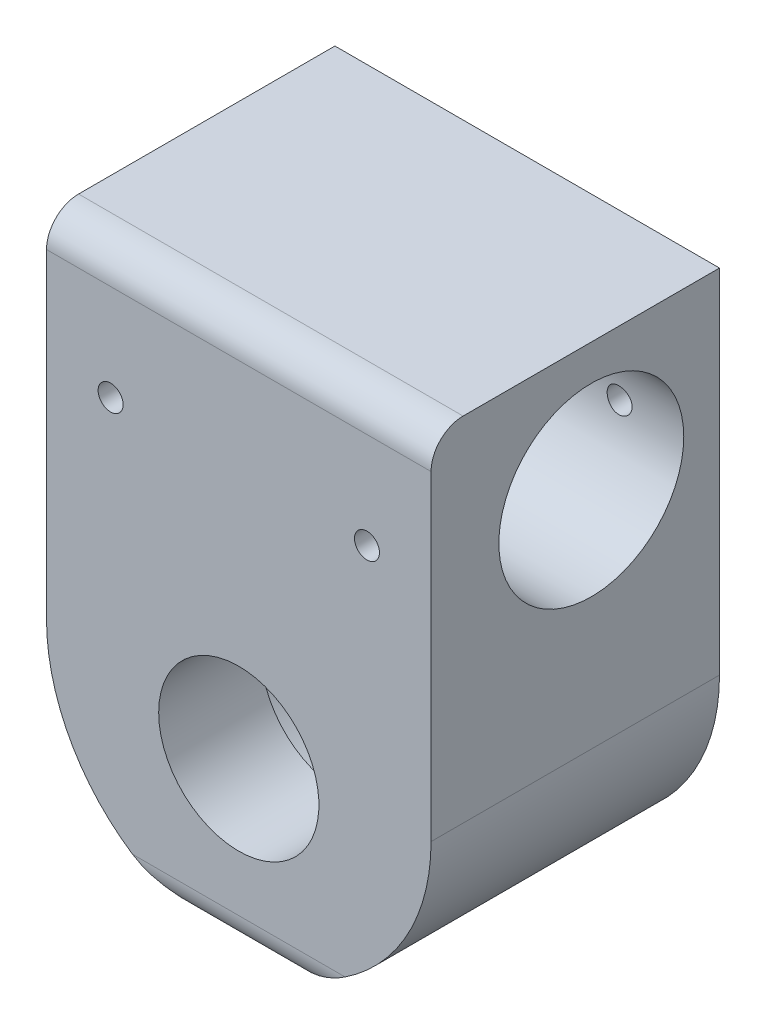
ISO-10303-21;
HEADER;
FILE_DESCRIPTION(('STEP AP214'),'2;1');
FILE_NAME('part.step','',(''),(''),'','','');
FILE_SCHEMA(('AUTOMOTIVE_DESIGN { 1 0 10303 214 1 1 1 1 }'));
ENDSEC;
DATA;
#1=APPLICATION_CONTEXT('core data for automotive mechanical design processes');
#2=APPLICATION_PROTOCOL_DEFINITION('international standard','automotive_design',2000,#1);
#3=PRODUCT_CONTEXT('',#1,'mechanical');
#4=PRODUCT('Part','Part','',(#3));
#5=PRODUCT_RELATED_PRODUCT_CATEGORY('part','',(#4));
#6=PRODUCT_DEFINITION_FORMATION('','',#4);
#7=PRODUCT_DEFINITION_CONTEXT('part definition',#1,'design');
#8=PRODUCT_DEFINITION('design','',#6,#7);
#9=PRODUCT_DEFINITION_SHAPE('','',#8);
#10=(LENGTH_UNIT() NAMED_UNIT(*) SI_UNIT(.MILLI.,.METRE.));
#11=(NAMED_UNIT(*) PLANE_ANGLE_UNIT() SI_UNIT($,.RADIAN.));
#12=(NAMED_UNIT(*) SI_UNIT($,.STERADIAN.) SOLID_ANGLE_UNIT());
#13=UNCERTAINTY_MEASURE_WITH_UNIT(LENGTH_MEASURE(1.E-05),#10,'distance_accuracy_value','');
#14=(GEOMETRIC_REPRESENTATION_CONTEXT(3) GLOBAL_UNCERTAINTY_ASSIGNED_CONTEXT((#13)) GLOBAL_UNIT_ASSIGNED_CONTEXT((#10,
#11,#12)) REPRESENTATION_CONTEXT('',''));
#15=CARTESIAN_POINT('',(0.,0.,0.));
#16=DIRECTION('',(0.,0.,1.));
#17=DIRECTION('',(1.,0.,0.));
#18=AXIS2_PLACEMENT_3D('',#15,#16,#17);
#19=CARTESIAN_POINT('',(0.,-63.5,114.3));
#20=DIRECTION('',(0.,0.,-1.));
#21=DIRECTION('',(-1.,0.,0.));
#22=AXIS2_PLACEMENT_3D('',#19,#20,#21);
#23=CYLINDRICAL_SURFACE('',#22,76.2);
#24=DIRECTION('',(0.,0.,-1.));
#25=VECTOR('',#24,1.);
#26=CARTESIAN_POINT('',(76.2,-63.5,114.3));
#27=LINE('',#26,#25);
#28=CARTESIAN_POINT('',(76.2,-63.5,114.3));
#29=VERTEX_POINT('',#28);
#30=CARTESIAN_POINT('',(76.2,-63.5,0.));
#31=VERTEX_POINT('',#30);
#32=EDGE_CURVE('E102',#29,#31,#27,.T.);
#33=ORIENTED_EDGE('',*,*,#32,.F.);
#34=CARTESIAN_POINT('',(0.,-63.5,114.3));
#35=DIRECTION('',(0.,0.,-1.));
#36=DIRECTION('',(-1.,0.,0.));
#37=AXIS2_PLACEMENT_3D('',#34,#35,#36);
#38=CIRCLE('',#37,76.2);
#39=CARTESIAN_POINT('',(42.1211348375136,-127.,114.3));
#40=VERTEX_POINT('',#39);
#41=EDGE_CURVE('E47',#40,#29,#38,.F.);
#42=ORIENTED_EDGE('',*,*,#41,.F.);
#43=CARTESIAN_POINT('',(0.,-139.7,101.6));
#44=CARTESIAN_POINT('',(0.0170377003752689,-139.699999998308,101.60695561));
#45=CARTESIAN_POINT('',(0.034075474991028,-139.699994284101,101.613911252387));
#46=CARTESIAN_POINT('',(2.03742847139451,-139.698650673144,102.431776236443));
#47=CARTESIAN_POINT('',(4.0247212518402,-139.619673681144,103.243032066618));
#48=CARTESIAN_POINT('',(7.00250718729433,-139.384106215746,104.444407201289));
#49=CARTESIAN_POINT('',(7.99501216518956,-139.285997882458,104.842452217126));
#50=CARTESIAN_POINT('',(9.97853241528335,-139.050421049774,105.630697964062));
#51=CARTESIAN_POINT('',(10.9695477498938,-138.912954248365,106.020899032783));
#52=CARTESIAN_POINT('',(12.9518201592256,-138.597936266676,106.791490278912));
#53=CARTESIAN_POINT('',(13.9430720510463,-138.420289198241,107.171854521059));
#54=CARTESIAN_POINT('',(15.9228290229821,-138.024643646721,107.918687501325));
#55=CARTESIAN_POINT('',(16.9113339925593,-137.806643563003,108.285155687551));
#56=CARTESIAN_POINT('',(18.884262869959,-137.329899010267,109.000530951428));
#57=CARTESIAN_POINT('',(19.8686886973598,-137.071176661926,109.349447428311));
#58=CARTESIAN_POINT('',(21.832988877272,-136.512349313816,110.026012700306));
#59=CARTESIAN_POINT('',(22.8128637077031,-136.212248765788,110.353663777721));
#60=CARTESIAN_POINT('',(24.9771687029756,-135.500990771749,111.051020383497));
#61=CARTESIAN_POINT('',(26.1603021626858,-135.079826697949,111.414630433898));
#62=CARTESIAN_POINT('',(28.5161425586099,-134.17433455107,112.094740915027));
#63=CARTESIAN_POINT('',(29.6888497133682,-133.690007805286,112.411242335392));
#64=CARTESIAN_POINT('',(31.434291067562,-132.917055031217,112.841203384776));
#65=CARTESIAN_POINT('',(32.0123214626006,-132.65242230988,112.976758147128));
#66=CARTESIAN_POINT('',(33.1644541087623,-132.107324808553,113.231671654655));
#67=CARTESIAN_POINT('',(33.7385566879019,-131.826861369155,113.351031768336));
#68=CARTESIAN_POINT('',(34.8822425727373,-131.250123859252,113.571707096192));
#69=CARTESIAN_POINT('',(35.4518261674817,-130.953850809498,113.673023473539));
#70=CARTESIAN_POINT('',(36.5857689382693,-130.345608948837,113.855517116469));
#71=CARTESIAN_POINT('',(37.1501285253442,-130.03364138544,113.93669597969));
#72=CARTESIAN_POINT('',(38.451388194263,-129.292519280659,114.098820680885));
#73=CARTESIAN_POINT('',(39.1860955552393,-128.857642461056,114.171485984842));
#74=CARTESIAN_POINT('',(40.6424150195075,-127.962112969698,114.271512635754));
#75=CARTESIAN_POINT('',(41.3640344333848,-127.501475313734,114.298900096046));
#76=CARTESIAN_POINT('',(42.4374430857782,-126.790519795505,114.300505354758));
#77=CARTESIAN_POINT('',(42.7952115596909,-126.549155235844,114.294352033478));
#78=CARTESIAN_POINT('',(43.5062227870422,-126.060647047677,114.267575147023));
#79=CARTESIAN_POINT('',(43.8594658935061,-125.813503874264,114.246952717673));
#80=CARTESIAN_POINT('',(44.5614700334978,-125.313439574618,114.190034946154));
#81=CARTESIAN_POINT('',(44.9102226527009,-125.06050953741,114.153713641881));
#82=CARTESIAN_POINT('',(45.6020762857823,-124.549782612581,114.064089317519));
#83=CARTESIAN_POINT('',(45.9451756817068,-124.291984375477,114.010781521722));
#84=CARTESIAN_POINT('',(46.2850648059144,-124.032080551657,113.948338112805));
#85=B_SPLINE_CURVE_WITH_KNOTS('',3,(#43,#44,#45,#46,#47,#48,#49,#50,#51,#52,#53,#54,#55,#56,#57,
#58,#59,#60,#61,#62,#63,#64,#65,#66,#67,#68,#69,#70,#71,#72,#73,#74,#75,#76,#77,#78,#79,#80,#81,
#82,#83,#84),.UNSPECIFIED.,.F.,.F.,(4,2,2,2,2,2,2,2,2,2,2,2,2,2,2,2,2,2,2,2,4),(0.,
0.0552086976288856,6.49157800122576,9.71259317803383,12.9334694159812,16.162114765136,
19.3908882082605,22.6179137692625,25.8445924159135,29.7647298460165,33.6847849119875,
35.6345088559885,37.5840679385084,39.5335012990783,41.4827799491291,44.051827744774,
46.6193933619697,47.9139912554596,49.2084875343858,50.5051328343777,51.8021430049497),.UNSPECIFIED.);
#86=CARTESIAN_POINT('',(0.,-139.7,101.6));
#87=VERTEX_POINT('',#86);
#88=EDGE_CURVE('E230',#87,#40,#85,.T.);
#89=ORIENTED_EDGE('',*,*,#88,.F.);
#90=DIRECTION('',(0.,0.,1.));
#91=VECTOR('',#90,1.);
#92=CARTESIAN_POINT('',(0.,-139.7,114.3));
#93=LINE('',#92,#91);
#94=CARTESIAN_POINT('',(0.,-139.7,0.));
#95=VERTEX_POINT('',#94);
#96=EDGE_CURVE('E157',#87,#95,#93,.F.);
#97=ORIENTED_EDGE('',*,*,#96,.T.);
#98=CARTESIAN_POINT('',(0.,-63.5,0.));
#99=DIRECTION('',(0.,0.,-1.));
#100=DIRECTION('',(-1.,0.,0.));
#101=AXIS2_PLACEMENT_3D('',#98,#99,#100);
#102=CIRCLE('',#101,76.2);
#103=EDGE_CURVE('E11',#31,#95,#102,.T.);
#104=ORIENTED_EDGE('',*,*,#103,.F.);
#105=EDGE_LOOP('',(#33,#42,#89,#97,#104));
#106=FACE_BOUND('',#105,.T.);
#107=ADVANCED_FACE('F34',(#106),#23,.T.);
#108=CARTESIAN_POINT('',(0.,-63.5,114.3));
#109=DIRECTION('',(0.,0.,1.));
#110=DIRECTION('',(1.,0.,0.));
#111=AXIS2_PLACEMENT_3D('',#108,#109,#110);
#112=CYLINDRICAL_SURFACE('',#111,76.2);
#113=DIRECTION('',(0.,0.,1.));
#114=VECTOR('',#113,1.);
#115=CARTESIAN_POINT('',(-76.2,-63.5,114.3));
#116=LINE('',#115,#114);
#117=CARTESIAN_POINT('',(-76.2,-63.5,0.));
#118=VERTEX_POINT('',#117);
#119=CARTESIAN_POINT('',(-76.2,-63.5,114.3));
#120=VERTEX_POINT('',#119);
#121=EDGE_CURVE('E144',#118,#120,#116,.T.);
#122=ORIENTED_EDGE('',*,*,#121,.F.);
#123=CARTESIAN_POINT('',(0.,-63.5,0.));
#124=DIRECTION('',(0.,0.,-1.));
#125=DIRECTION('',(-1.,0.,0.));
#126=AXIS2_PLACEMENT_3D('',#123,#124,#125);
#127=CIRCLE('',#126,76.2);
#128=EDGE_CURVE('E231',#95,#118,#127,.T.);
#129=ORIENTED_EDGE('',*,*,#128,.F.);
#130=ORIENTED_EDGE('',*,*,#96,.F.);
#131=CARTESIAN_POINT('',(-42.1211348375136,-127.,114.3));
#132=CARTESIAN_POINT('',(-41.6720587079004,-127.29789461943,114.299965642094));
#133=CARTESIAN_POINT('',(-41.2198731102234,-127.590969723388,114.28952012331));
#134=CARTESIAN_POINT('',(-40.3101054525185,-128.167030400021,114.249568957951));
#135=CARTESIAN_POINT('',(-39.8525248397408,-128.450018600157,114.220068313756));
#136=CARTESIAN_POINT('',(-38.9332683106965,-129.005179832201,114.143826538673));
#137=CARTESIAN_POINT('',(-38.4715998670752,-129.277368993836,114.097112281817));
#138=CARTESIAN_POINT('',(-37.5440212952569,-129.811182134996,113.987956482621));
#139=CARTESIAN_POINT('',(-37.0781108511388,-130.072805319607,113.925513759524));
#140=CARTESIAN_POINT('',(-35.6797528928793,-130.838849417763,113.717444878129));
#141=CARTESIAN_POINT('',(-34.7416983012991,-131.327449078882,113.550634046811));
#142=CARTESIAN_POINT('',(-32.8535333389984,-132.26187942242,113.1696716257));
#143=CARTESIAN_POINT('',(-31.9034162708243,-132.707685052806,112.955492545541));
#144=CARTESIAN_POINT('',(-30.0591378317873,-133.527393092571,112.503527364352));
#145=CARTESIAN_POINT('',(-29.1655879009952,-133.904127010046,112.268353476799));
#146=CARTESIAN_POINT('',(-27.3717723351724,-134.620736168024,111.768833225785));
#147=CARTESIAN_POINT('',(-26.4715056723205,-134.960605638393,111.504482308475));
#148=CARTESIAN_POINT('',(-24.6651294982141,-135.604029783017,110.950980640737));
#149=CARTESIAN_POINT('',(-23.7590172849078,-135.907566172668,110.661817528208));
#150=CARTESIAN_POINT('',(-21.9424144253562,-136.478606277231,110.06269851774));
#151=CARTESIAN_POINT('',(-21.0319239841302,-136.746111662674,109.752743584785));
#152=CARTESIAN_POINT('',(-19.2043072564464,-137.246424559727,109.114371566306));
#153=CARTESIAN_POINT('',(-18.287168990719,-137.479114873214,108.785897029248));
#154=CARTESIAN_POINT('',(-16.449978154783,-137.909195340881,108.114474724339));
#155=CARTESIAN_POINT('',(-15.5299255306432,-138.106584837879,107.771526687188));
#156=CARTESIAN_POINT('',(-12.7671742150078,-138.646255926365,106.725469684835));
#157=CARTESIAN_POINT('',(-10.9206651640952,-138.936371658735,106.004715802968));
#158=CARTESIAN_POINT('',(-7.56935550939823,-139.338215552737,104.67359254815));
#159=CARTESIAN_POINT('',(-6.06537250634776,-139.47318636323,104.067852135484));
#160=CARTESIAN_POINT('',(-3.05785098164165,-139.653493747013,102.848321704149));
#161=CARTESIAN_POINT('',(-1.55431566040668,-139.698974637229,102.234546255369));
#162=CARTESIAN_POINT('',(-0.0340755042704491,-139.699994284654,101.613911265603));
#163=CARTESIAN_POINT('',(-0.0170377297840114,-139.699999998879,101.60695562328));
#164=CARTESIAN_POINT('',(0.,-139.7,101.6));
#165=B_SPLINE_CURVE_WITH_KNOTS('',3,(#131,#132,#133,#134,#135,#136,#137,#138,#139,#140,#141,
#142,#143,#144,#145,#146,#147,#148,#149,#150,#151,#152,#153,#154,#155,#156,#157,#158,#159,#160,
#161,#162,#163,#164),.UNSPECIFIED.,.F.,.F.,(4,2,2,2,2,2,2,2,2,2,2,2,2,2,2,2,4),(0.,
1.61645535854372,3.23248653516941,4.84600536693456,6.45964536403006,9.66946355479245,
12.8811494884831,15.8734327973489,18.8661837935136,21.8604346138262,24.8545465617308,
27.8585211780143,30.8625517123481,36.8666229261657,41.7454171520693,46.6163370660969,
46.6715457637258),.UNSPECIFIED.);
#166=CARTESIAN_POINT('',(-42.1211348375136,-127.,114.3));
#167=VERTEX_POINT('',#166);
#168=EDGE_CURVE('E150',#167,#87,#165,.T.);
#169=ORIENTED_EDGE('',*,*,#168,.F.);
#170=CARTESIAN_POINT('',(0.,-63.5,114.3));
#171=DIRECTION('',(0.,0.,-1.));
#172=DIRECTION('',(-1.,0.,0.));
#173=AXIS2_PLACEMENT_3D('',#170,#171,#172);
#174=CIRCLE('',#173,76.2);
#175=EDGE_CURVE('E147',#120,#167,#174,.F.);
#176=ORIENTED_EDGE('',*,*,#175,.F.);
#177=EDGE_LOOP('',(#122,#129,#130,#169,#176));
#178=FACE_BOUND('',#177,.T.);
#179=ADVANCED_FACE('F163',(#178),#112,.T.);
#180=CARTESIAN_POINT('',(0.,-73.152,114.3));
#181=DIRECTION('',(0.,0.,-1.));
#182=DIRECTION('',(-1.,0.,0.));
#183=AXIS2_PLACEMENT_3D('',#180,#181,#182);
#184=CYLINDRICAL_SURFACE('',#183,31.75);
#185=CARTESIAN_POINT('',(0.,-73.152,114.3));
#186=DIRECTION('',(0.,0.,-1.));
#187=DIRECTION('',(-1.,0.,0.));
#188=AXIS2_PLACEMENT_3D('',#185,#186,#187);
#189=CIRCLE('',#188,31.75);
#190=CARTESIAN_POINT('',(-31.75,-73.152,114.3));
#191=VERTEX_POINT('',#190);
#192=EDGE_CURVE('E132',#191,#191,#189,.T.);
#193=ORIENTED_EDGE('',*,*,#192,.F.);
#194=EDGE_LOOP('',(#193));
#195=FACE_BOUND('',#194,.T.);
#196=CARTESIAN_POINT('',(0.,-73.152,73.66));
#197=DIRECTION('',(0.,0.,-1.));
#198=DIRECTION('',(-1.,0.,0.));
#199=AXIS2_PLACEMENT_3D('',#196,#197,#198);
#200=CIRCLE('',#199,31.75);
#201=CARTESIAN_POINT('',(-31.75,-73.152,73.66));
#202=VERTEX_POINT('',#201);
#203=EDGE_CURVE('E129',#202,#202,#200,.F.);
#204=ORIENTED_EDGE('',*,*,#203,.F.);
#205=EDGE_LOOP('',(#204));
#206=FACE_BOUND('',#205,.T.);
#207=ADVANCED_FACE('F167',(#195,#206),#184,.F.);
#208=CARTESIAN_POINT('',(-76.2,-139.7,114.3));
#209=DIRECTION('',(1.,0.,0.));
#210=DIRECTION('',(0.,0.,-1.));
#211=AXIS2_PLACEMENT_3D('',#208,#209,#210);
#212=PLANE('',#211);
#213=CARTESIAN_POINT('',(-76.2,25.4,50.8));
#214=DIRECTION('',(1.,0.,0.));
#215=DIRECTION('',(0.,0.,-1.));
#216=AXIS2_PLACEMENT_3D('',#213,#214,#215);
#217=CIRCLE('',#216,36.6395);
#218=CARTESIAN_POINT('',(-76.2,25.4,14.1605));
#219=VERTEX_POINT('',#218);
#220=EDGE_CURVE('E277',#219,#219,#217,.T.);
#221=ORIENTED_EDGE('',*,*,#220,.T.);
#222=EDGE_LOOP('',(#221));
#223=FACE_BOUND('',#222,.T.);
#224=DIRECTION('',(0.,-1.,0.));
#225=VECTOR('',#224,1.);
#226=CARTESIAN_POINT('',(-76.2,-139.7,0.));
#227=LINE('',#226,#225);
#228=CARTESIAN_POINT('',(-76.2,76.2,0.));
#229=VERTEX_POINT('',#228);
#230=EDGE_CURVE('E106',#229,#118,#227,.T.);
#231=ORIENTED_EDGE('',*,*,#230,.T.);
#232=ORIENTED_EDGE('',*,*,#121,.T.);
#233=DIRECTION('',(0.,-1.,0.));
#234=VECTOR('',#233,1.);
#235=CARTESIAN_POINT('',(-76.2,-139.7,114.3));
#236=LINE('',#235,#234);
#237=CARTESIAN_POINT('',(-76.2,63.5,114.3));
#238=VERTEX_POINT('',#237);
#239=EDGE_CURVE('E120',#238,#120,#236,.T.);
#240=ORIENTED_EDGE('',*,*,#239,.F.);
#241=CARTESIAN_POINT('',(-76.2,63.5,101.6));
#242=DIRECTION('',(1.,0.,0.));
#243=DIRECTION('',(0.,0.,-1.));
#244=AXIS2_PLACEMENT_3D('',#241,#242,#243);
#245=CIRCLE('',#244,12.7);
#246=CARTESIAN_POINT('',(-76.2,76.2,101.6));
#247=VERTEX_POINT('',#246);
#248=EDGE_CURVE('E136',#238,#247,#245,.F.);
#249=ORIENTED_EDGE('',*,*,#248,.T.);
#250=DIRECTION('',(0.,0.,-1.));
#251=VECTOR('',#250,1.);
#252=CARTESIAN_POINT('',(-76.2,76.2,114.3));
#253=LINE('',#252,#251);
#254=EDGE_CURVE('E116',#247,#229,#253,.T.);
#255=ORIENTED_EDGE('',*,*,#254,.T.);
#256=EDGE_LOOP('',(#231,#232,#240,#249,#255));
#257=FACE_BOUND('',#256,.T.);
#258=ADVANCED_FACE('F169',(#223,#257),#212,.F.);
#259=CARTESIAN_POINT('',(76.2,-139.7,114.3));
#260=DIRECTION('',(-1.,0.,0.));
#261=DIRECTION('',(0.,0.,1.));
#262=AXIS2_PLACEMENT_3D('',#259,#260,#261);
#263=PLANE('',#262);
#264=CARTESIAN_POINT('',(76.2,25.4,50.8));
#265=DIRECTION('',(1.,0.,0.));
#266=DIRECTION('',(0.,0.,-1.));
#267=AXIS2_PLACEMENT_3D('',#264,#265,#266);
#268=CIRCLE('',#267,36.6395);
#269=CARTESIAN_POINT('',(76.2,25.4,14.1605));
#270=VERTEX_POINT('',#269);
#271=EDGE_CURVE('E274',#270,#270,#268,.T.);
#272=ORIENTED_EDGE('',*,*,#271,.F.);
#273=EDGE_LOOP('',(#272));
#274=FACE_BOUND('',#273,.T.);
#275=DIRECTION('',(0.,1.,0.));
#276=VECTOR('',#275,1.);
#277=CARTESIAN_POINT('',(76.2,-139.7,114.3));
#278=LINE('',#277,#276);
#279=CARTESIAN_POINT('',(76.2,63.5,114.3));
#280=VERTEX_POINT('',#279);
#281=EDGE_CURVE('E123',#29,#280,#278,.T.);
#282=ORIENTED_EDGE('',*,*,#281,.F.);
#283=ORIENTED_EDGE('',*,*,#32,.T.);
#284=DIRECTION('',(0.,1.,0.));
#285=VECTOR('',#284,1.);
#286=CARTESIAN_POINT('',(76.2,-139.7,0.));
#287=LINE('',#286,#285);
#288=CARTESIAN_POINT('',(76.2,76.2,0.));
#289=VERTEX_POINT('',#288);
#290=EDGE_CURVE('E95',#31,#289,#287,.T.);
#291=ORIENTED_EDGE('',*,*,#290,.T.);
#292=DIRECTION('',(0.,0.,-1.));
#293=VECTOR('',#292,1.);
#294=CARTESIAN_POINT('',(76.2,76.2,114.3));
#295=LINE('',#294,#293);
#296=CARTESIAN_POINT('',(76.2,76.2,101.6));
#297=VERTEX_POINT('',#296);
#298=EDGE_CURVE('E100',#297,#289,#295,.T.);
#299=ORIENTED_EDGE('',*,*,#298,.F.);
#300=CARTESIAN_POINT('',(76.2,63.5,101.6));
#301=DIRECTION('',(-1.,0.,0.));
#302=DIRECTION('',(0.,0.,1.));
#303=AXIS2_PLACEMENT_3D('',#300,#301,#302);
#304=CIRCLE('',#303,12.7);
#305=EDGE_CURVE('E139',#297,#280,#304,.F.);
#306=ORIENTED_EDGE('',*,*,#305,.T.);
#307=EDGE_LOOP('',(#282,#283,#291,#299,#306));
#308=FACE_BOUND('',#307,.T.);
#309=ADVANCED_FACE('F98',(#274,#308),#263,.F.);
#310=CARTESIAN_POINT('',(-76.2,76.2,114.3));
#311=DIRECTION('',(0.,-1.,0.));
#312=DIRECTION('',(0.,0.,-1.));
#313=AXIS2_PLACEMENT_3D('',#310,#311,#312);
#314=PLANE('',#313);
#315=ORIENTED_EDGE('',*,*,#254,.F.);
#316=DIRECTION('',(-1.,0.,0.));
#317=VECTOR('',#316,1.);
#318=CARTESIAN_POINT('',(-76.2,76.2,101.6));
#319=LINE('',#318,#317);
#320=EDGE_CURVE('E114',#247,#297,#319,.F.);
#321=ORIENTED_EDGE('',*,*,#320,.T.);
#322=ORIENTED_EDGE('',*,*,#298,.T.);
#323=DIRECTION('',(-1.,0.,0.));
#324=VECTOR('',#323,1.);
#325=CARTESIAN_POINT('',(-76.2,76.2,0.));
#326=LINE('',#325,#324);
#327=EDGE_CURVE('E105',#289,#229,#326,.T.);
#328=ORIENTED_EDGE('',*,*,#327,.T.);
#329=EDGE_LOOP('',(#315,#321,#322,#328));
#330=FACE_BOUND('',#329,.T.);
#331=ADVANCED_FACE('F111',(#330),#314,.F.);
#332=CARTESIAN_POINT('',(-76.2,76.2,114.3));
#333=DIRECTION('',(0.,0.,-1.));
#334=DIRECTION('',(-1.,0.,0.));
#335=AXIS2_PLACEMENT_3D('',#332,#333,#334);
#336=PLANE('',#335);
#337=CARTESIAN_POINT('',(50.8,25.4,114.3));
#338=DIRECTION('',(0.,0.,1.));
#339=DIRECTION('',(1.,0.,0.));
#340=AXIS2_PLACEMENT_3D('',#337,#338,#339);
#341=CIRCLE('',#340,4.953);
#342=CARTESIAN_POINT('',(55.753,25.4,114.3));
#343=VERTEX_POINT('',#342);
#344=EDGE_CURVE('E299',#343,#343,#341,.T.);
#345=ORIENTED_EDGE('',*,*,#344,.F.);
#346=EDGE_LOOP('',(#345));
#347=FACE_BOUND('',#346,.T.);
#348=CARTESIAN_POINT('',(-50.8,25.4,114.3));
#349=DIRECTION('',(0.,0.,1.));
#350=DIRECTION('',(1.,0.,0.));
#351=AXIS2_PLACEMENT_3D('',#348,#349,#350);
#352=CIRCLE('',#351,4.953);
#353=CARTESIAN_POINT('',(-45.847,25.4,114.3));
#354=VERTEX_POINT('',#353);
#355=EDGE_CURVE('E294',#354,#354,#352,.T.);
#356=ORIENTED_EDGE('',*,*,#355,.F.);
#357=EDGE_LOOP('',(#356));
#358=FACE_BOUND('',#357,.T.);
#359=ORIENTED_EDGE('',*,*,#192,.T.);
#360=EDGE_LOOP('',(#359));
#361=FACE_BOUND('',#360,.T.);
#362=DIRECTION('',(1.,0.,0.));
#363=VECTOR('',#362,1.);
#364=CARTESIAN_POINT('',(-76.2,-127.,114.3));
#365=LINE('',#364,#363);
#366=EDGE_CURVE('E141',#167,#40,#365,.T.);
#367=ORIENTED_EDGE('',*,*,#366,.T.);
#368=ORIENTED_EDGE('',*,*,#41,.T.);
#369=ORIENTED_EDGE('',*,*,#281,.T.);
#370=DIRECTION('',(-1.,0.,0.));
#371=VECTOR('',#370,1.);
#372=CARTESIAN_POINT('',(-76.2,63.5,114.3));
#373=LINE('',#372,#371);
#374=EDGE_CURVE('E115',#280,#238,#373,.T.);
#375=ORIENTED_EDGE('',*,*,#374,.T.);
#376=ORIENTED_EDGE('',*,*,#239,.T.);
#377=ORIENTED_EDGE('',*,*,#175,.T.);
#378=EDGE_LOOP('',(#367,#368,#369,#375,#376,#377));
#379=FACE_BOUND('',#378,.T.);
#380=ADVANCED_FACE('F178',(#347,#358,#361,#379),#336,.F.);
#381=CARTESIAN_POINT('',(-76.2,76.2,0.));
#382=DIRECTION('',(0.,0.,-1.));
#383=DIRECTION('',(-1.,0.,0.));
#384=AXIS2_PLACEMENT_3D('',#381,#382,#383);
#385=PLANE('',#384);
#386=CARTESIAN_POINT('',(50.8,25.4,0.));
#387=DIRECTION('',(0.,0.,1.));
#388=DIRECTION('',(1.,0.,0.));
#389=AXIS2_PLACEMENT_3D('',#386,#387,#388);
#390=CIRCLE('',#389,4.953);
#391=CARTESIAN_POINT('',(55.753,25.4,0.));
#392=VERTEX_POINT('',#391);
#393=EDGE_CURVE('E206',#392,#392,#390,.T.);
#394=ORIENTED_EDGE('',*,*,#393,.T.);
#395=EDGE_LOOP('',(#394));
#396=FACE_BOUND('',#395,.T.);
#397=CARTESIAN_POINT('',(-50.8,25.4,0.));
#398=DIRECTION('',(0.,0.,1.));
#399=DIRECTION('',(1.,0.,0.));
#400=AXIS2_PLACEMENT_3D('',#397,#398,#399);
#401=CIRCLE('',#400,4.953);
#402=CARTESIAN_POINT('',(-45.847,25.4,0.));
#403=VERTEX_POINT('',#402);
#404=EDGE_CURVE('E291',#403,#403,#401,.T.);
#405=ORIENTED_EDGE('',*,*,#404,.T.);
#406=EDGE_LOOP('',(#405));
#407=FACE_BOUND('',#406,.T.);
#408=CARTESIAN_POINT('',(0.,-73.152,0.));
#409=DIRECTION('',(0.,0.,-1.));
#410=DIRECTION('',(-1.,0.,0.));
#411=AXIS2_PLACEMENT_3D('',#408,#409,#410);
#412=CIRCLE('',#411,55.0545);
#413=CARTESIAN_POINT('',(-55.0545,-73.152,0.));
#414=VERTEX_POINT('',#413);
#415=EDGE_CURVE('E288',#414,#414,#412,.T.);
#416=ORIENTED_EDGE('',*,*,#415,.F.);
#417=EDGE_LOOP('',(#416));
#418=FACE_BOUND('',#417,.T.);
#419=ORIENTED_EDGE('',*,*,#290,.F.);
#420=ORIENTED_EDGE('',*,*,#103,.T.);
#421=ORIENTED_EDGE('',*,*,#128,.T.);
#422=ORIENTED_EDGE('',*,*,#230,.F.);
#423=ORIENTED_EDGE('',*,*,#327,.F.);
#424=EDGE_LOOP('',(#419,#420,#421,#422,#423));
#425=FACE_BOUND('',#424,.T.);
#426=ADVANCED_FACE('F118',(#396,#407,#418,#425),#385,.T.);
#427=CARTESIAN_POINT('',(-76.2,25.4,50.8));
#428=DIRECTION('',(1.,0.,0.));
#429=DIRECTION('',(0.,0.,-1.));
#430=AXIS2_PLACEMENT_3D('',#427,#428,#429);
#431=CYLINDRICAL_SURFACE('',#430,36.6395);
#432=CARTESIAN_POINT('',(45.847,25.4,14.1605));
#433=CARTESIAN_POINT('',(45.84699829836,25.538477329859,14.1604993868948));
#434=CARTESIAN_POINT('',(45.8528093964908,25.6769301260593,14.1612865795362));
#435=CARTESIAN_POINT('',(45.8760084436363,25.9528883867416,14.1644120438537));
#436=CARTESIAN_POINT('',(45.8933989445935,26.0903936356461,14.1667506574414));
#437=CARTESIAN_POINT('',(45.93964732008,26.3635261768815,14.1729163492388));
#438=CARTESIAN_POINT('',(45.9685134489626,26.4991520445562,14.1767444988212));
#439=CARTESIAN_POINT('',(46.0375095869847,26.7675141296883,14.1857828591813));
#440=CARTESIAN_POINT('',(46.0776437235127,26.9002492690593,14.190993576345));
#441=CARTESIAN_POINT('',(46.1688257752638,27.1616984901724,14.2026437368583));
#442=CARTESIAN_POINT('',(46.2198618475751,27.2904167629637,14.2090818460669));
#443=CARTESIAN_POINT('',(46.3325231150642,27.5431298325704,14.2230130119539));
#444=CARTESIAN_POINT('',(46.3941522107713,27.6671228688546,14.2305064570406));
#445=CARTESIAN_POINT('',(46.5275087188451,27.9094100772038,14.2463332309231));
#446=CARTESIAN_POINT('',(46.5992306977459,28.0277072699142,14.2546661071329));
#447=CARTESIAN_POINT('',(46.7523195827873,28.2579023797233,14.2719466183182));
#448=CARTESIAN_POINT('',(46.8336900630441,28.3697979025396,14.2808944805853));
#449=CARTESIAN_POINT('',(47.0059466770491,28.5869543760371,14.2992024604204));
#450=CARTESIAN_POINT('',(47.0968813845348,28.6921766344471,14.3085645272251));
#451=CARTESIAN_POINT('',(47.2873034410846,28.8946375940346,14.3273964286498));
#452=CARTESIAN_POINT('',(47.3867939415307,28.9918733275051,14.3368663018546));
#453=CARTESIAN_POINT('',(47.5935750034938,29.1776124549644,14.3556408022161));
#454=CARTESIAN_POINT('',(47.7008631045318,29.2661185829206,14.3649454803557));
#455=CARTESIAN_POINT('',(47.9225642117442,29.4338443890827,14.3831332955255));
#456=CARTESIAN_POINT('',(48.0369798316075,29.5130606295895,14.3920162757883));
#457=CARTESIAN_POINT('',(48.2725312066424,29.661875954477,14.4091356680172));
#458=CARTESIAN_POINT('',(48.3936897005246,29.7314393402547,14.4173696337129));
#459=CARTESIAN_POINT('',(48.6415391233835,29.8601304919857,14.43292149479));
#460=CARTESIAN_POINT('',(48.7682320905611,29.9192543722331,14.4402390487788));
#461=CARTESIAN_POINT('',(49.0261724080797,30.0265795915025,14.4537394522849));
#462=CARTESIAN_POINT('',(49.1574178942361,30.0747853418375,14.4599227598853));
#463=CARTESIAN_POINT('',(49.4235734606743,30.1599601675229,14.4709818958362));
#464=CARTESIAN_POINT('',(49.5584848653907,30.1969251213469,14.4758572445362));
#465=CARTESIAN_POINT('',(49.9655119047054,30.2900705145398,14.4882346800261));
#466=CARTESIAN_POINT('',(50.2417981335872,30.3292800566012,14.4935895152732));
#467=CARTESIAN_POINT('',(50.7969259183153,30.3608061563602,14.4978845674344));
#468=CARTESIAN_POINT('',(51.0757673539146,30.3531249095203,14.4968250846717));
#469=CARTESIAN_POINT('',(51.6263043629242,30.2913800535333,14.4884548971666));
#470=CARTESIAN_POINT('',(51.8980352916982,30.2376274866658,14.4811861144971));
#471=CARTESIAN_POINT('',(52.4285740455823,30.0857352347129,14.4612788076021));
#472=CARTESIAN_POINT('',(52.6873815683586,29.9875945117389,14.4486401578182));
#473=CARTESIAN_POINT('',(53.1856988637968,29.7493859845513,14.4193708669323));
#474=CARTESIAN_POINT('',(53.4251438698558,29.6091843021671,14.4027275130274));
#475=CARTESIAN_POINT('',(53.8772253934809,29.2909280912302,14.3673334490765));
#476=CARTESIAN_POINT('',(54.0898604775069,29.1128715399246,14.3485826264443));
#477=CARTESIAN_POINT('',(54.484092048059,28.7222423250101,14.310900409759));
#478=CARTESIAN_POINT('',(54.6654231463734,28.5094017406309,14.2919687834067));
#479=CARTESIAN_POINT('',(54.9898283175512,28.0561650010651,14.2561997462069));
#480=CARTESIAN_POINT('',(55.1329022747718,27.8157687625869,14.2393623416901));
#481=CARTESIAN_POINT('',(55.3767372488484,27.3140302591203,14.2096658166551));
#482=CARTESIAN_POINT('',(55.4774801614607,27.0526790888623,14.1968083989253));
#483=CARTESIAN_POINT('',(55.6335749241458,26.5165567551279,14.1765354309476));
#484=CARTESIAN_POINT('',(55.6889292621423,26.2417863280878,14.1691195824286));
#485=CARTESIAN_POINT('',(55.7523281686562,25.688918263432,14.1606043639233));
#486=CARTESIAN_POINT('',(55.7607380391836,25.4108632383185,14.1594562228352));
#487=CARTESIAN_POINT('',(55.7309754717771,24.8573098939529,14.1634736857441));
#488=CARTESIAN_POINT('',(55.6928041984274,24.581811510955,14.1686391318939));
#489=CARTESIAN_POINT('',(55.571266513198,24.042280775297,14.1846731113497));
#490=CARTESIAN_POINT('',(55.4880757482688,23.778208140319,14.1955194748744));
#491=CARTESIAN_POINT('',(55.2790441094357,23.2677607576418,14.2217018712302));
#492=CARTESIAN_POINT('',(55.1532015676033,23.021386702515,14.2370380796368));
#493=CARTESIAN_POINT('',(54.8615653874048,22.5517083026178,14.2706141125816));
#494=CARTESIAN_POINT('',(54.6955372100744,22.3285508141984,14.2888707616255));
#495=CARTESIAN_POINT('',(54.3285714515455,21.9131379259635,14.326196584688));
#496=CARTESIAN_POINT('',(54.1276322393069,21.7208839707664,14.345265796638));
#497=CARTESIAN_POINT('',(53.6949361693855,21.3714262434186,14.382219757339));
#498=CARTESIAN_POINT('',(53.4629820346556,21.2144656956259,14.4000957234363));
#499=CARTESIAN_POINT('',(52.975776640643,20.9417359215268,14.4324899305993));
#500=CARTESIAN_POINT('',(52.7205259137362,20.8259657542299,14.4470082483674));
#501=CARTESIAN_POINT('',(52.1947870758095,20.6392853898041,14.4709836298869));
#502=CARTESIAN_POINT('',(51.9243469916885,20.5682416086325,14.4804557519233));
#503=CARTESIAN_POINT('',(51.3750850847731,20.4726207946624,14.4933019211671));
#504=CARTESIAN_POINT('',(51.0962637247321,20.4480412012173,14.4966763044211));
#505=CARTESIAN_POINT('',(50.6793254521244,20.4465301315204,14.4968875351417));
#506=CARTESIAN_POINT('',(50.5410527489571,20.4518383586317,14.4961606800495));
#507=CARTESIAN_POINT('',(50.2654657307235,20.4739921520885,14.4931471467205));
#508=CARTESIAN_POINT('',(50.1281510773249,20.4908334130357,14.4908610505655));
#509=CARTESIAN_POINT('',(49.8554042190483,20.5359407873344,14.4847911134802));
#510=CARTESIAN_POINT('',(49.7199727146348,20.5642110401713,14.481006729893));
#511=CARTESIAN_POINT('',(49.4520373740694,20.631951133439,14.472051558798));
#512=CARTESIAN_POINT('',(49.3195324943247,20.6714169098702,14.4668812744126));
#513=CARTESIAN_POINT('',(49.0583519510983,20.7612565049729,14.4553020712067));
#514=CARTESIAN_POINT('',(48.9296757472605,20.8116287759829,14.4488933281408));
#515=CARTESIAN_POINT('',(48.6770732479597,20.9228992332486,14.4350213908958));
#516=CARTESIAN_POINT('',(48.5531452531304,20.9837936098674,14.4275585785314));
#517=CARTESIAN_POINT('',(48.3107997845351,21.1157110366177,14.4117843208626));
#518=CARTESIAN_POINT('',(48.1923843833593,21.186737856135,14.403472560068));
#519=CARTESIAN_POINT('',(47.9619668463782,21.3383757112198,14.3862390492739));
#520=CARTESIAN_POINT('',(47.8499624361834,21.4189833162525,14.3773175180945));
#521=CARTESIAN_POINT('',(47.6321969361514,21.5899408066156,14.3590360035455));
#522=CARTESIAN_POINT('',(47.5264944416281,21.6803650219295,14.3496730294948));
#523=CARTESIAN_POINT('',(47.3231081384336,21.8697404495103,14.3308448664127));
#524=CARTESIAN_POINT('',(47.2254214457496,21.9686885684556,14.3213797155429));
#525=CARTESIAN_POINT('',(47.0386463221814,22.1745153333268,14.3026043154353));
#526=CARTESIAN_POINT('',(46.9495631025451,22.2813987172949,14.2932941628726));
#527=CARTESIAN_POINT('',(46.7807172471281,22.5022611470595,14.2750997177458));
#528=CARTESIAN_POINT('',(46.7009511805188,22.616237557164,14.2662152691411));
#529=CARTESIAN_POINT('',(46.5509042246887,22.8510972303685,14.2490768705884));
#530=CARTESIAN_POINT('',(46.480670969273,22.9720111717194,14.2408261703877));
#531=CARTESIAN_POINT('',(46.350679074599,23.2193432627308,14.225240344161));
#532=CARTESIAN_POINT('',(46.2909165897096,23.3457593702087,14.2179048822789));
#533=CARTESIAN_POINT('',(46.1823140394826,23.6031476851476,14.204359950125));
#534=CARTESIAN_POINT('',(46.1334656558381,23.7341163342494,14.1981496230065));
#535=CARTESIAN_POINT('',(46.0470081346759,23.999719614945,14.187026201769));
#536=CARTESIAN_POINT('',(46.009396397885,24.1343533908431,14.1821128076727));
#537=CARTESIAN_POINT('',(45.9342369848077,24.4552342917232,14.1722165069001));
#538=CARTESIAN_POINT('',(45.9015578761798,24.6426619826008,14.1678416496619));
#539=CARTESIAN_POINT('',(45.8579406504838,25.0200751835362,14.1619838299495));
#540=CARTESIAN_POINT('',(45.8470023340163,25.2100606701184,14.160500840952));
#541=CARTESIAN_POINT('',(45.847,25.4,14.1605));
#542=B_SPLINE_CURVE_WITH_KNOTS('',3,(#432,#433,#434,#435,#436,#437,#438,#439,#440,#441,#442,
#443,#444,#445,#446,#447,#448,#449,#450,#451,#452,#453,#454,#455,#456,#457,#458,#459,#460,#461,
#462,#463,#464,#465,#466,#467,#468,#469,#470,#471,#472,#473,#474,#475,#476,#477,#478,#479,#480,
#481,#482,#483,#484,#485,#486,#487,#488,#489,#490,#491,#492,#493,#494,#495,#496,#497,#498,#499,
#500,#501,#502,#503,#504,#505,#506,#507,#508,#509,#510,#511,#512,#513,#514,#515,#516,#517,#518,
#519,#520,#521,#522,#523,#524,#525,#526,#527,#528,#529,#530,#531,#532,#533,#534,#535,#536,#537,
#538,#539,#540,#541),.UNSPECIFIED.,.T.,.F.,(4,2,2,2,2,2,2,2,2,2,2,2,2,2,2,2,2,2,2,2,2,2,2,2,2,2,
2,2,2,2,2,2,2,2,2,2,2,2,2,2,2,2,2,2,2,2,2,2,2,2,2,2,2,2,4),(0.,0.415265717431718,
0.830622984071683,1.24627955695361,1.66208858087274,2.07744818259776,2.49296105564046,
2.90825108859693,3.32369544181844,3.74136213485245,4.15918333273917,4.57687325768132,
4.99471726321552,5.41406756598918,5.83357362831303,6.2529098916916,6.67239972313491,
7.5053516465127,8.33826457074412,9.16559813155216,9.992951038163,10.8229658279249,
11.6530249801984,12.4898082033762,13.3265939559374,14.1637372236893,15.0008346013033,
15.8314088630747,16.6619623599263,17.489298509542,18.3166670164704,19.1489860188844,
19.981343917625,20.819273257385,21.6571834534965,22.4925790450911,23.3279285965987,
23.7426541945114,24.1572250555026,24.5719462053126,24.9865170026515,25.4010290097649,
25.8153912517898,26.229908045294,26.6442768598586,27.062036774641,27.4796457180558,
27.8975060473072,28.3152120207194,28.7349338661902,29.1545012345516,29.5737477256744,
29.9928971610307,30.5624923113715,31.13208223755),.UNSPECIFIED.);
#543=CARTESIAN_POINT('',(45.847,25.4,14.1605));
#544=VERTEX_POINT('',#543);
#545=EDGE_CURVE('E38',#544,#544,#542,.T.);
#546=ORIENTED_EDGE('',*,*,#545,.T.);
#547=EDGE_LOOP('',(#546));
#548=FACE_BOUND('',#547,.T.);
#549=CARTESIAN_POINT('',(55.753,25.4,87.4395));
#550=CARTESIAN_POINT('',(55.7530017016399,25.538477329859,87.4395006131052));
#551=CARTESIAN_POINT('',(55.7471906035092,25.6769301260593,87.4387134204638));
#552=CARTESIAN_POINT('',(55.7239915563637,25.9528883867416,87.4355879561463));
#553=CARTESIAN_POINT('',(55.7066010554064,26.0903936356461,87.4332493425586));
#554=CARTESIAN_POINT('',(55.66035267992,26.3635261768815,87.4270836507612));
#555=CARTESIAN_POINT('',(55.6314865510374,26.4991520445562,87.4232555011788));
#556=CARTESIAN_POINT('',(55.5624904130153,26.7675141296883,87.4142171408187));
#557=CARTESIAN_POINT('',(55.5223562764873,26.9002492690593,87.409006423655));
#558=CARTESIAN_POINT('',(55.4311742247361,27.1616984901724,87.3973562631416));
#559=CARTESIAN_POINT('',(55.3801381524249,27.2904167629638,87.3909181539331));
#560=CARTESIAN_POINT('',(55.2674768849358,27.5431298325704,87.3769869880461));
#561=CARTESIAN_POINT('',(55.2058477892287,27.6671228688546,87.3694935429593));
#562=CARTESIAN_POINT('',(55.0724912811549,27.9094100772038,87.3536667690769));
#563=CARTESIAN_POINT('',(55.0007693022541,28.0277072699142,87.3453338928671));
#564=CARTESIAN_POINT('',(54.8476804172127,28.2579023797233,87.3280533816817));
#565=CARTESIAN_POINT('',(54.7663099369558,28.3697979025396,87.3191055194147));
#566=CARTESIAN_POINT('',(54.5940533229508,28.5869543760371,87.3007975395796));
#567=CARTESIAN_POINT('',(54.5031186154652,28.6921766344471,87.2914354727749));
#568=CARTESIAN_POINT('',(54.3126965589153,28.8946375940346,87.2726035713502));
#569=CARTESIAN_POINT('',(54.2132060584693,28.9918733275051,87.2631336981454));
#570=CARTESIAN_POINT('',(54.0064249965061,29.1776124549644,87.2443591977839));
#571=CARTESIAN_POINT('',(53.8991368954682,29.2661185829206,87.2350545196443));
#572=CARTESIAN_POINT('',(53.6774357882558,29.4338443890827,87.2168667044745));
#573=CARTESIAN_POINT('',(53.5630201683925,29.5130606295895,87.2079837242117));
#574=CARTESIAN_POINT('',(53.3274687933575,29.661875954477,87.1908643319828));
#575=CARTESIAN_POINT('',(53.2063102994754,29.7314393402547,87.1826303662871));
#576=CARTESIAN_POINT('',(52.9584608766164,29.8601304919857,87.16707850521));
#577=CARTESIAN_POINT('',(52.8317679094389,29.9192543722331,87.1597609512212));
#578=CARTESIAN_POINT('',(52.5738275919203,30.0265795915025,87.1462605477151));
#579=CARTESIAN_POINT('',(52.4425821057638,30.0747853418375,87.1400772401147));
#580=CARTESIAN_POINT('',(52.1764265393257,30.1599601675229,87.1290181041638));
#581=CARTESIAN_POINT('',(52.0415151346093,30.1969251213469,87.1241427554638));
#582=CARTESIAN_POINT('',(51.6344880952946,30.2900705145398,87.1117653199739));
#583=CARTESIAN_POINT('',(51.3582018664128,30.3292800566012,87.1064104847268));
#584=CARTESIAN_POINT('',(50.8030740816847,30.3608061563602,87.1021154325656));
#585=CARTESIAN_POINT('',(50.5242326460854,30.3531249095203,87.1031749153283));
#586=CARTESIAN_POINT('',(49.9736956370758,30.2913800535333,87.1115451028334));
#587=CARTESIAN_POINT('',(49.7019647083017,30.2376274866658,87.1188138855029));
#588=CARTESIAN_POINT('',(49.1714259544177,30.0857352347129,87.1387211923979));
#589=CARTESIAN_POINT('',(48.9126184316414,29.9875945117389,87.1513598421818));
#590=CARTESIAN_POINT('',(48.4143011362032,29.7493859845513,87.1806291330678));
#591=CARTESIAN_POINT('',(48.1748561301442,29.6091843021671,87.1972724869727));
#592=CARTESIAN_POINT('',(47.722774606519,29.2909280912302,87.2326665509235));
#593=CARTESIAN_POINT('',(47.5101395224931,29.1128715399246,87.2514173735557));
#594=CARTESIAN_POINT('',(47.115907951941,28.7222423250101,87.289099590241));
#595=CARTESIAN_POINT('',(46.9345768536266,28.5094017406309,87.3080312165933));
#596=CARTESIAN_POINT('',(46.6101716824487,28.0561650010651,87.343800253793));
#597=CARTESIAN_POINT('',(46.4670977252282,27.8157687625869,87.36063765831));
#598=CARTESIAN_POINT('',(46.2232627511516,27.3140302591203,87.3903341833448));
#599=CARTESIAN_POINT('',(46.1225198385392,27.0526790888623,87.4031916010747));
#600=CARTESIAN_POINT('',(45.9664250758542,26.5165567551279,87.4234645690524));
#601=CARTESIAN_POINT('',(45.9110707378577,26.2417863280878,87.4308804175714));
#602=CARTESIAN_POINT('',(45.8476718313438,25.688918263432,87.4393956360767));
#603=CARTESIAN_POINT('',(45.8392619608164,25.4108632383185,87.4405437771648));
#604=CARTESIAN_POINT('',(45.8690245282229,24.8573098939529,87.4365263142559));
#605=CARTESIAN_POINT('',(45.9071958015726,24.581811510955,87.4313608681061));
#606=CARTESIAN_POINT('',(46.0287334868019,24.042280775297,87.4153268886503));
#607=CARTESIAN_POINT('',(46.1119242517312,23.778208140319,87.4044805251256));
#608=CARTESIAN_POINT('',(46.3209558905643,23.2677607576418,87.3782981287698));
#609=CARTESIAN_POINT('',(46.4467984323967,23.021386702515,87.3629619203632));
#610=CARTESIAN_POINT('',(46.7384346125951,22.5517083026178,87.3293858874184));
#611=CARTESIAN_POINT('',(46.9044627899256,22.3285508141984,87.3111292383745));
#612=CARTESIAN_POINT('',(47.2714285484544,21.9131379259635,87.273803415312));
#613=CARTESIAN_POINT('',(47.4723677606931,21.7208839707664,87.254734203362));
#614=CARTESIAN_POINT('',(47.9050638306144,21.3714262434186,87.217780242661));
#615=CARTESIAN_POINT('',(48.1370179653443,21.2144656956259,87.1999042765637));
#616=CARTESIAN_POINT('',(48.624223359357,20.9417359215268,87.1675100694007));
#617=CARTESIAN_POINT('',(48.8794740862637,20.8259657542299,87.1529917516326));
#618=CARTESIAN_POINT('',(49.4052129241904,20.6392853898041,87.1290163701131));
#619=CARTESIAN_POINT('',(49.6756530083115,20.5682416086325,87.1195442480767));
#620=CARTESIAN_POINT('',(50.2249149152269,20.4726207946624,87.1066980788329));
#621=CARTESIAN_POINT('',(50.5037362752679,20.4480412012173,87.1033236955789));
#622=CARTESIAN_POINT('',(50.9206745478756,20.4465301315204,87.1031124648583));
#623=CARTESIAN_POINT('',(51.0589472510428,20.4518383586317,87.1038393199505));
#624=CARTESIAN_POINT('',(51.3345342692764,20.4739921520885,87.1068528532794));
#625=CARTESIAN_POINT('',(51.4718489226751,20.4908334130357,87.1091389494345));
#626=CARTESIAN_POINT('',(51.7445957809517,20.5359407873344,87.1152088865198));
#627=CARTESIAN_POINT('',(51.8800272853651,20.5642110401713,87.118993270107));
#628=CARTESIAN_POINT('',(52.1479626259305,20.631951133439,87.127948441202));
#629=CARTESIAN_POINT('',(52.2804675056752,20.6714169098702,87.1331187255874));
#630=CARTESIAN_POINT('',(52.5416480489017,20.7612565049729,87.1446979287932));
#631=CARTESIAN_POINT('',(52.6703242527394,20.8116287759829,87.1511066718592));
#632=CARTESIAN_POINT('',(52.9229267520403,20.9228992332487,87.1649786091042));
#633=CARTESIAN_POINT('',(53.0468547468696,20.9837936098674,87.1724414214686));
#634=CARTESIAN_POINT('',(53.2892002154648,21.1157110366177,87.1882156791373));
#635=CARTESIAN_POINT('',(53.4076156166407,21.186737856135,87.196527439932));
#636=CARTESIAN_POINT('',(53.6380331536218,21.3383757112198,87.2137609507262));
#637=CARTESIAN_POINT('',(53.7500375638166,21.4189833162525,87.2226824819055));
#638=CARTESIAN_POINT('',(53.9678030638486,21.5899408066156,87.2409639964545));
#639=CARTESIAN_POINT('',(54.0735055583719,21.6803650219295,87.2503269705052));
#640=CARTESIAN_POINT('',(54.2768918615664,21.8697404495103,87.2691551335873));
#641=CARTESIAN_POINT('',(54.3745785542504,21.9686885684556,87.2786202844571));
#642=CARTESIAN_POINT('',(54.5613536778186,22.1745153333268,87.2973956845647));
#643=CARTESIAN_POINT('',(54.6504368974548,22.2813987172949,87.3067058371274));
#644=CARTESIAN_POINT('',(54.8192827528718,22.5022611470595,87.3249002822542));
#645=CARTESIAN_POINT('',(54.8990488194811,22.616237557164,87.3337847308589));
#646=CARTESIAN_POINT('',(55.0490957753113,22.8510972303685,87.3509231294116));
#647=CARTESIAN_POINT('',(55.119329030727,22.9720111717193,87.3591738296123));
#648=CARTESIAN_POINT('',(55.249320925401,23.2193432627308,87.374759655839));
#649=CARTESIAN_POINT('',(55.3090834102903,23.3457593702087,87.3820951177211));
#650=CARTESIAN_POINT('',(55.4176859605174,23.6031476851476,87.395640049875));
#651=CARTESIAN_POINT('',(55.4665343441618,23.7341163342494,87.4018503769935));
#652=CARTESIAN_POINT('',(55.5529918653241,23.999719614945,87.412973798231));
#653=CARTESIAN_POINT('',(55.590603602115,24.1343533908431,87.4178871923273));
#654=CARTESIAN_POINT('',(55.6657630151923,24.4552342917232,87.4277834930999));
#655=CARTESIAN_POINT('',(55.6984421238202,24.6426619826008,87.4321583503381));
#656=CARTESIAN_POINT('',(55.7420593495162,25.0200751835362,87.4380161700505));
#657=CARTESIAN_POINT('',(55.7529976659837,25.2100606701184,87.439499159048));
#658=CARTESIAN_POINT('',(55.753,25.4,87.4395));
#659=B_SPLINE_CURVE_WITH_KNOTS('',3,(#549,#550,#551,#552,#553,#554,#555,#556,#557,#558,#559,
#560,#561,#562,#563,#564,#565,#566,#567,#568,#569,#570,#571,#572,#573,#574,#575,#576,#577,#578,
#579,#580,#581,#582,#583,#584,#585,#586,#587,#588,#589,#590,#591,#592,#593,#594,#595,#596,#597,
#598,#599,#600,#601,#602,#603,#604,#605,#606,#607,#608,#609,#610,#611,#612,#613,#614,#615,#616,
#617,#618,#619,#620,#621,#622,#623,#624,#625,#626,#627,#628,#629,#630,#631,#632,#633,#634,#635,
#636,#637,#638,#639,#640,#641,#642,#643,#644,#645,#646,#647,#648,#649,#650,#651,#652,#653,#654,
#655,#656,#657,#658),.UNSPECIFIED.,.T.,.F.,(4,2,2,2,2,2,2,2,2,2,2,2,2,2,2,2,2,2,2,2,2,2,2,2,2,2,
2,2,2,2,2,2,2,2,2,2,2,2,2,2,2,2,2,2,2,2,2,2,2,2,2,2,2,2,4),(0.,0.415265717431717,
0.830622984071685,1.24627955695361,1.66208858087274,2.07744818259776,2.49296105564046,
2.90825108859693,3.32369544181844,3.74136213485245,4.15918333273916,4.57687325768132,
4.99471726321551,5.41406756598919,5.83357362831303,6.2529098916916,6.67239972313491,
7.5053516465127,8.33826457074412,9.16559813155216,9.99295103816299,10.8229658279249,
11.6530249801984,12.4898082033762,13.3265939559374,14.1637372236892,15.0008346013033,
15.8314088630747,16.6619623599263,17.489298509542,18.3166670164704,19.1489860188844,
19.981343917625,20.819273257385,21.6571834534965,22.4925790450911,23.3279285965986,
23.7426541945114,24.1572250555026,24.5719462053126,24.9865170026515,25.4010290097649,
25.8153912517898,26.229908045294,26.6442768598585,27.062036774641,27.4796457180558,
27.8975060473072,28.3152120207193,28.7349338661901,29.1545012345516,29.5737477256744,
29.9928971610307,30.5624923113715,31.13208223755),.UNSPECIFIED.);
#660=CARTESIAN_POINT('',(55.753,25.4,87.4395));
#661=VERTEX_POINT('',#660);
#662=EDGE_CURVE('E202',#661,#661,#659,.T.);
#663=ORIENTED_EDGE('',*,*,#662,.T.);
#664=EDGE_LOOP('',(#663));
#665=FACE_BOUND('',#664,.T.);
#666=CARTESIAN_POINT('',(-55.753,25.4,14.1605));
#667=CARTESIAN_POINT('',(-55.7530017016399,25.538477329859,14.1604993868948));
#668=CARTESIAN_POINT('',(-55.7471906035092,25.6769301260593,14.1612865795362));
#669=CARTESIAN_POINT('',(-55.7239915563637,25.9528883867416,14.1644120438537));
#670=CARTESIAN_POINT('',(-55.7066010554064,26.0903936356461,14.1667506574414));
#671=CARTESIAN_POINT('',(-55.66035267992,26.3635261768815,14.1729163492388));
#672=CARTESIAN_POINT('',(-55.6314865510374,26.4991520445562,14.1767444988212));
#673=CARTESIAN_POINT('',(-55.5624904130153,26.7675141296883,14.1857828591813));
#674=CARTESIAN_POINT('',(-55.5223562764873,26.9002492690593,14.190993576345));
#675=CARTESIAN_POINT('',(-55.4311742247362,27.1616984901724,14.2026437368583));
#676=CARTESIAN_POINT('',(-55.3801381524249,27.2904167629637,14.2090818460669));
#677=CARTESIAN_POINT('',(-55.2674768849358,27.5431298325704,14.2230130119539));
#678=CARTESIAN_POINT('',(-55.2058477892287,27.6671228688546,14.2305064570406));
#679=CARTESIAN_POINT('',(-55.0724912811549,27.9094100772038,14.2463332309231));
#680=CARTESIAN_POINT('',(-55.0007693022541,28.0277072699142,14.2546661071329));
#681=CARTESIAN_POINT('',(-54.8476804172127,28.2579023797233,14.2719466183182));
#682=CARTESIAN_POINT('',(-54.7663099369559,28.3697979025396,14.2808944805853));
#683=CARTESIAN_POINT('',(-54.5940533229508,28.5869543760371,14.2992024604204));
#684=CARTESIAN_POINT('',(-54.5031186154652,28.6921766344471,14.3085645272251));
#685=CARTESIAN_POINT('',(-54.3126965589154,28.8946375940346,14.3273964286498));
#686=CARTESIAN_POINT('',(-54.2132060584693,28.9918733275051,14.3368663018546));
#687=CARTESIAN_POINT('',(-54.0064249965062,29.1776124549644,14.3556408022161));
#688=CARTESIAN_POINT('',(-53.8991368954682,29.2661185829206,14.3649454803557));
#689=CARTESIAN_POINT('',(-53.6774357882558,29.4338443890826,14.3831332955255));
#690=CARTESIAN_POINT('',(-53.5630201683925,29.5130606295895,14.3920162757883));
#691=CARTESIAN_POINT('',(-53.3274687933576,29.661875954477,14.4091356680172));
#692=CARTESIAN_POINT('',(-53.2063102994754,29.7314393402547,14.4173696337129));
#693=CARTESIAN_POINT('',(-52.9584608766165,29.8601304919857,14.43292149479));
#694=CARTESIAN_POINT('',(-52.8317679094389,29.9192543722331,14.4402390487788));
#695=CARTESIAN_POINT('',(-52.5738275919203,30.0265795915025,14.4537394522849));
#696=CARTESIAN_POINT('',(-52.4425821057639,30.0747853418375,14.4599227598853));
#697=CARTESIAN_POINT('',(-52.1764265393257,30.1599601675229,14.4709818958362));
#698=CARTESIAN_POINT('',(-52.0415151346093,30.1969251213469,14.4758572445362));
#699=CARTESIAN_POINT('',(-51.6344880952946,30.2900705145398,14.4882346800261));
#700=CARTESIAN_POINT('',(-51.3582018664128,30.3292800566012,14.4935895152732));
#701=CARTESIAN_POINT('',(-50.8030740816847,30.3608061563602,14.4978845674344));
#702=CARTESIAN_POINT('',(-50.5242326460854,30.3531249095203,14.4968250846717));
#703=CARTESIAN_POINT('',(-49.9736956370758,30.2913800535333,14.4884548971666));
#704=CARTESIAN_POINT('',(-49.7019647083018,30.2376274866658,14.4811861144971));
#705=CARTESIAN_POINT('',(-49.1714259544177,30.0857352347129,14.4612788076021));
#706=CARTESIAN_POINT('',(-48.9126184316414,29.9875945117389,14.4486401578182));
#707=CARTESIAN_POINT('',(-48.4143011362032,29.7493859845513,14.4193708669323));
#708=CARTESIAN_POINT('',(-48.1748561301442,29.6091843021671,14.4027275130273));
#709=CARTESIAN_POINT('',(-47.7227746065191,29.2909280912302,14.3673334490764));
#710=CARTESIAN_POINT('',(-47.5101395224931,29.1128715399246,14.3485826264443));
#711=CARTESIAN_POINT('',(-47.115907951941,28.7222423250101,14.310900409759));
#712=CARTESIAN_POINT('',(-46.9345768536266,28.5094017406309,14.2919687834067));
#713=CARTESIAN_POINT('',(-46.6101716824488,28.0561650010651,14.2561997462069));
#714=CARTESIAN_POINT('',(-46.4670977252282,27.8157687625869,14.23936234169));
#715=CARTESIAN_POINT('',(-46.2232627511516,27.3140302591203,14.2096658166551));
#716=CARTESIAN_POINT('',(-46.1225198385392,27.0526790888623,14.1968083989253));
#717=CARTESIAN_POINT('',(-45.9664250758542,26.5165567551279,14.1765354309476));
#718=CARTESIAN_POINT('',(-45.9110707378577,26.2417863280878,14.1691195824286));
#719=CARTESIAN_POINT('',(-45.8476718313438,25.688918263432,14.1606043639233));
#720=CARTESIAN_POINT('',(-45.8392619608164,25.4108632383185,14.1594562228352));
#721=CARTESIAN_POINT('',(-45.8690245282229,24.8573098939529,14.1634736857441));
#722=CARTESIAN_POINT('',(-45.9071958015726,24.581811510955,14.1686391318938));
#723=CARTESIAN_POINT('',(-46.0287334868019,24.042280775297,14.1846731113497));
#724=CARTESIAN_POINT('',(-46.1119242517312,23.778208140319,14.1955194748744));
#725=CARTESIAN_POINT('',(-46.3209558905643,23.2677607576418,14.2217018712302));
#726=CARTESIAN_POINT('',(-46.4467984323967,23.021386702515,14.2370380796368));
#727=CARTESIAN_POINT('',(-46.7384346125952,22.5517083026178,14.2706141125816));
#728=CARTESIAN_POINT('',(-46.9044627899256,22.3285508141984,14.2888707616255));
#729=CARTESIAN_POINT('',(-47.2714285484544,21.9131379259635,14.326196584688));
#730=CARTESIAN_POINT('',(-47.4723677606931,21.7208839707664,14.345265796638));
#731=CARTESIAN_POINT('',(-47.9050638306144,21.3714262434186,14.382219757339));
#732=CARTESIAN_POINT('',(-48.1370179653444,21.2144656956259,14.4000957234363));
#733=CARTESIAN_POINT('',(-48.624223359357,20.9417359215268,14.4324899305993));
#734=CARTESIAN_POINT('',(-48.8794740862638,20.8259657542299,14.4470082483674));
#735=CARTESIAN_POINT('',(-49.4052129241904,20.6392853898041,14.4709836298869));
#736=CARTESIAN_POINT('',(-49.6756530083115,20.5682416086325,14.4804557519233));
#737=CARTESIAN_POINT('',(-50.2249149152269,20.4726207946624,14.4933019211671));
#738=CARTESIAN_POINT('',(-50.5037362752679,20.4480412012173,14.4966763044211));
#739=CARTESIAN_POINT('',(-50.9206745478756,20.4465301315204,14.4968875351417));
#740=CARTESIAN_POINT('',(-51.0589472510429,20.4518383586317,14.4961606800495));
#741=CARTESIAN_POINT('',(-51.3345342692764,20.4739921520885,14.4931471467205));
#742=CARTESIAN_POINT('',(-51.4718489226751,20.4908334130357,14.4908610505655));
#743=CARTESIAN_POINT('',(-51.7445957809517,20.5359407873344,14.4847911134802));
#744=CARTESIAN_POINT('',(-51.8800272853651,20.5642110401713,14.481006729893));
#745=CARTESIAN_POINT('',(-52.1479626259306,20.631951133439,14.472051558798));
#746=CARTESIAN_POINT('',(-52.2804675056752,20.6714169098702,14.4668812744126));
#747=CARTESIAN_POINT('',(-52.5416480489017,20.7612565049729,14.4553020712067));
#748=CARTESIAN_POINT('',(-52.6703242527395,20.8116287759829,14.4488933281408));
#749=CARTESIAN_POINT('',(-52.9229267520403,20.9228992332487,14.4350213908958));
#750=CARTESIAN_POINT('',(-53.0468547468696,20.9837936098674,14.4275585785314));
#751=CARTESIAN_POINT('',(-53.2892002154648,21.1157110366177,14.4117843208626));
#752=CARTESIAN_POINT('',(-53.4076156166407,21.186737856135,14.403472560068));
#753=CARTESIAN_POINT('',(-53.6380331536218,21.3383757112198,14.3862390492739));
#754=CARTESIAN_POINT('',(-53.7500375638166,21.4189833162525,14.3773175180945));
#755=CARTESIAN_POINT('',(-53.9678030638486,21.5899408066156,14.3590360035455));
#756=CARTESIAN_POINT('',(-54.0735055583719,21.6803650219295,14.3496730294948));
#757=CARTESIAN_POINT('',(-54.2768918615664,21.8697404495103,14.3308448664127));
#758=CARTESIAN_POINT('',(-54.3745785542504,21.9686885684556,14.3213797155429));
#759=CARTESIAN_POINT('',(-54.5613536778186,22.1745153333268,14.3026043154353));
#760=CARTESIAN_POINT('',(-54.6504368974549,22.2813987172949,14.2932941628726));
#761=CARTESIAN_POINT('',(-54.8192827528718,22.5022611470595,14.2750997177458));
#762=CARTESIAN_POINT('',(-54.8990488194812,22.616237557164,14.2662152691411));
#763=CARTESIAN_POINT('',(-55.0490957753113,22.8510972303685,14.2490768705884));
#764=CARTESIAN_POINT('',(-55.119329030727,22.9720111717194,14.2408261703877));
#765=CARTESIAN_POINT('',(-55.249320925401,23.2193432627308,14.225240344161));
#766=CARTESIAN_POINT('',(-55.3090834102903,23.3457593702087,14.2179048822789));
#767=CARTESIAN_POINT('',(-55.4176859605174,23.6031476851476,14.204359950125));
#768=CARTESIAN_POINT('',(-55.4665343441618,23.7341163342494,14.1981496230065));
#769=CARTESIAN_POINT('',(-55.5529918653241,23.999719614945,14.187026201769));
#770=CARTESIAN_POINT('',(-55.590603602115,24.1343533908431,14.1821128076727));
#771=CARTESIAN_POINT('',(-55.6657630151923,24.4552342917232,14.1722165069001));
#772=CARTESIAN_POINT('',(-55.6984421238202,24.6426619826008,14.1678416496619));
#773=CARTESIAN_POINT('',(-55.7420593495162,25.0200751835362,14.1619838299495));
#774=CARTESIAN_POINT('',(-55.7529976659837,25.2100606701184,14.160500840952));
#775=CARTESIAN_POINT('',(-55.753,25.4,14.1605));
#776=B_SPLINE_CURVE_WITH_KNOTS('',3,(#666,#667,#668,#669,#670,#671,#672,#673,#674,#675,#676,
#677,#678,#679,#680,#681,#682,#683,#684,#685,#686,#687,#688,#689,#690,#691,#692,#693,#694,#695,
#696,#697,#698,#699,#700,#701,#702,#703,#704,#705,#706,#707,#708,#709,#710,#711,#712,#713,#714,
#715,#716,#717,#718,#719,#720,#721,#722,#723,#724,#725,#726,#727,#728,#729,#730,#731,#732,#733,
#734,#735,#736,#737,#738,#739,#740,#741,#742,#743,#744,#745,#746,#747,#748,#749,#750,#751,#752,
#753,#754,#755,#756,#757,#758,#759,#760,#761,#762,#763,#764,#765,#766,#767,#768,#769,#770,#771,
#772,#773,#774,#775),.UNSPECIFIED.,.T.,.F.,(4,2,2,2,2,2,2,2,2,2,2,2,2,2,2,2,2,2,2,2,2,2,2,2,2,2,
2,2,2,2,2,2,2,2,2,2,2,2,2,2,2,2,2,2,2,2,2,2,2,2,2,2,2,2,4),(0.,0.415265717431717,
0.830622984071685,1.24627955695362,1.66208858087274,2.07744818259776,2.49296105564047,
2.90825108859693,3.32369544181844,3.74136213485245,4.15918333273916,4.57687325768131,
4.99471726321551,5.41406756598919,5.83357362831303,6.25290989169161,6.67239972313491,
7.50535164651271,8.33826457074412,9.16559813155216,9.99295103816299,10.8229658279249,
11.6530249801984,12.4898082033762,13.3265939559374,14.1637372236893,15.0008346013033,
15.8314088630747,16.6619623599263,17.489298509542,18.3166670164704,19.1489860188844,
19.9813439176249,20.819273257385,21.6571834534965,22.4925790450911,23.3279285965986,
23.7426541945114,24.1572250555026,24.5719462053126,24.9865170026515,25.4010290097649,
25.8153912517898,26.229908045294,26.6442768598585,27.062036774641,27.4796457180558,
27.8975060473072,28.3152120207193,28.7349338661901,29.1545012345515,29.5737477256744,
29.9928971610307,30.5624923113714,31.13208223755),.UNSPECIFIED.);
#777=CARTESIAN_POINT('',(-55.753,25.4,14.1605));
#778=VERTEX_POINT('',#777);
#779=EDGE_CURVE('E199',#778,#778,#776,.T.);
#780=ORIENTED_EDGE('',*,*,#779,.T.);
#781=EDGE_LOOP('',(#780));
#782=FACE_BOUND('',#781,.T.);
#783=CARTESIAN_POINT('',(-45.847,25.4,87.4395));
#784=CARTESIAN_POINT('',(-45.8469982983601,25.538477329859,87.4395006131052));
#785=CARTESIAN_POINT('',(-45.8528093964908,25.6769301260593,87.4387134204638));
#786=CARTESIAN_POINT('',(-45.8760084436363,25.9528883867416,87.4355879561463));
#787=CARTESIAN_POINT('',(-45.8933989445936,26.0903936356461,87.4332493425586));
#788=CARTESIAN_POINT('',(-45.93964732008,26.3635261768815,87.4270836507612));
#789=CARTESIAN_POINT('',(-45.9685134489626,26.4991520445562,87.4232555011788));
#790=CARTESIAN_POINT('',(-46.0375095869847,26.7675141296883,87.4142171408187));
#791=CARTESIAN_POINT('',(-46.0776437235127,26.9002492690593,87.409006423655));
#792=CARTESIAN_POINT('',(-46.1688257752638,27.1616984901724,87.3973562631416));
#793=CARTESIAN_POINT('',(-46.2198618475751,27.2904167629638,87.3909181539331));
#794=CARTESIAN_POINT('',(-46.3325231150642,27.5431298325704,87.3769869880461));
#795=CARTESIAN_POINT('',(-46.3941522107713,27.6671228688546,87.3694935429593));
#796=CARTESIAN_POINT('',(-46.5275087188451,27.9094100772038,87.3536667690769));
#797=CARTESIAN_POINT('',(-46.5992306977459,28.0277072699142,87.3453338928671));
#798=CARTESIAN_POINT('',(-46.7523195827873,28.2579023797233,87.3280533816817));
#799=CARTESIAN_POINT('',(-46.8336900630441,28.3697979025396,87.3191055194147));
#800=CARTESIAN_POINT('',(-47.0059466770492,28.586954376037,87.3007975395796));
#801=CARTESIAN_POINT('',(-47.0968813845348,28.6921766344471,87.2914354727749));
#802=CARTESIAN_POINT('',(-47.2873034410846,28.8946375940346,87.2726035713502));
#803=CARTESIAN_POINT('',(-47.3867939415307,28.9918733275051,87.2631336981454));
#804=CARTESIAN_POINT('',(-47.5935750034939,29.1776124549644,87.2443591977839));
#805=CARTESIAN_POINT('',(-47.7008631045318,29.2661185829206,87.2350545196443));
#806=CARTESIAN_POINT('',(-47.9225642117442,29.4338443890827,87.2168667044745));
#807=CARTESIAN_POINT('',(-48.0369798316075,29.5130606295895,87.2079837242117));
#808=CARTESIAN_POINT('',(-48.2725312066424,29.661875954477,87.1908643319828));
#809=CARTESIAN_POINT('',(-48.3936897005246,29.7314393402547,87.1826303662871));
#810=CARTESIAN_POINT('',(-48.6415391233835,29.8601304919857,87.16707850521));
#811=CARTESIAN_POINT('',(-48.7682320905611,29.9192543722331,87.1597609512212));
#812=CARTESIAN_POINT('',(-49.0261724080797,30.0265795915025,87.1462605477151));
#813=CARTESIAN_POINT('',(-49.1574178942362,30.0747853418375,87.1400772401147));
#814=CARTESIAN_POINT('',(-49.4235734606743,30.1599601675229,87.1290181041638));
#815=CARTESIAN_POINT('',(-49.5584848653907,30.1969251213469,87.1241427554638));
#816=CARTESIAN_POINT('',(-49.9655119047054,30.2900705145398,87.1117653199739));
#817=CARTESIAN_POINT('',(-50.2417981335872,30.3292800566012,87.1064104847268));
#818=CARTESIAN_POINT('',(-50.7969259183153,30.3608061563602,87.1021154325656));
#819=CARTESIAN_POINT('',(-51.0757673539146,30.3531249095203,87.1031749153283));
#820=CARTESIAN_POINT('',(-51.6263043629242,30.2913800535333,87.1115451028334));
#821=CARTESIAN_POINT('',(-51.8980352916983,30.2376274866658,87.1188138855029));
#822=CARTESIAN_POINT('',(-52.4285740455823,30.0857352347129,87.1387211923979));
#823=CARTESIAN_POINT('',(-52.6873815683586,29.9875945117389,87.1513598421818));
#824=CARTESIAN_POINT('',(-53.1856988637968,29.7493859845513,87.1806291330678));
#825=CARTESIAN_POINT('',(-53.4251438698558,29.6091843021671,87.1972724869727));
#826=CARTESIAN_POINT('',(-53.8772253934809,29.2909280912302,87.2326665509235));
#827=CARTESIAN_POINT('',(-54.0898604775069,29.1128715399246,87.2514173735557));
#828=CARTESIAN_POINT('',(-54.484092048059,28.7222423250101,87.289099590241));
#829=CARTESIAN_POINT('',(-54.6654231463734,28.5094017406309,87.3080312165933));
#830=CARTESIAN_POINT('',(-54.9898283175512,28.0561650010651,87.343800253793));
#831=CARTESIAN_POINT('',(-55.1329022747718,27.8157687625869,87.36063765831));
#832=CARTESIAN_POINT('',(-55.3767372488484,27.3140302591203,87.3903341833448));
#833=CARTESIAN_POINT('',(-55.4774801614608,27.0526790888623,87.4031916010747));
#834=CARTESIAN_POINT('',(-55.6335749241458,26.5165567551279,87.4234645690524));
#835=CARTESIAN_POINT('',(-55.6889292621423,26.2417863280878,87.4308804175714));
#836=CARTESIAN_POINT('',(-55.7523281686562,25.688918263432,87.4393956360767));
#837=CARTESIAN_POINT('',(-55.7607380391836,25.4108632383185,87.4405437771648));
#838=CARTESIAN_POINT('',(-55.7309754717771,24.8573098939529,87.4365263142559));
#839=CARTESIAN_POINT('',(-55.6928041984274,24.581811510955,87.4313608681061));
#840=CARTESIAN_POINT('',(-55.5712665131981,24.042280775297,87.4153268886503));
#841=CARTESIAN_POINT('',(-55.4880757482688,23.778208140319,87.4044805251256));
#842=CARTESIAN_POINT('',(-55.2790441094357,23.2677607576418,87.3782981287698));
#843=CARTESIAN_POINT('',(-55.1532015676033,23.021386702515,87.3629619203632));
#844=CARTESIAN_POINT('',(-54.8615653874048,22.5517083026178,87.3293858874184));
#845=CARTESIAN_POINT('',(-54.6955372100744,22.3285508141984,87.3111292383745));
#846=CARTESIAN_POINT('',(-54.3285714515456,21.9131379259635,87.273803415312));
#847=CARTESIAN_POINT('',(-54.1276322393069,21.7208839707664,87.254734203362));
#848=CARTESIAN_POINT('',(-53.6949361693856,21.3714262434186,87.217780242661));
#849=CARTESIAN_POINT('',(-53.4629820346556,21.2144656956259,87.1999042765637));
#850=CARTESIAN_POINT('',(-52.975776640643,20.9417359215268,87.1675100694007));
#851=CARTESIAN_POINT('',(-52.7205259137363,20.8259657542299,87.1529917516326));
#852=CARTESIAN_POINT('',(-52.1947870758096,20.6392853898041,87.1290163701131));
#853=CARTESIAN_POINT('',(-51.9243469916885,20.5682416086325,87.1195442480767));
#854=CARTESIAN_POINT('',(-51.3750850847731,20.4726207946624,87.1066980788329));
#855=CARTESIAN_POINT('',(-51.0962637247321,20.4480412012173,87.1033236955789));
#856=CARTESIAN_POINT('',(-50.6793254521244,20.4465301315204,87.1031124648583));
#857=CARTESIAN_POINT('',(-50.5410527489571,20.4518383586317,87.1038393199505));
#858=CARTESIAN_POINT('',(-50.2654657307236,20.4739921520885,87.1068528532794));
#859=CARTESIAN_POINT('',(-50.1281510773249,20.4908334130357,87.1091389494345));
#860=CARTESIAN_POINT('',(-49.8554042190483,20.5359407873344,87.1152088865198));
#861=CARTESIAN_POINT('',(-49.7199727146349,20.5642110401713,87.118993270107));
#862=CARTESIAN_POINT('',(-49.4520373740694,20.631951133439,87.127948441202));
#863=CARTESIAN_POINT('',(-49.3195324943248,20.6714169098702,87.1331187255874));
#864=CARTESIAN_POINT('',(-49.0583519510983,20.7612565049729,87.1446979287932));
#865=CARTESIAN_POINT('',(-48.9296757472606,20.8116287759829,87.1511066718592));
#866=CARTESIAN_POINT('',(-48.6770732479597,20.9228992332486,87.1649786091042));
#867=CARTESIAN_POINT('',(-48.5531452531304,20.9837936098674,87.1724414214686));
#868=CARTESIAN_POINT('',(-48.3107997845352,21.1157110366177,87.1882156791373));
#869=CARTESIAN_POINT('',(-48.1923843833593,21.186737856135,87.196527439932));
#870=CARTESIAN_POINT('',(-47.9619668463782,21.3383757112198,87.2137609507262));
#871=CARTESIAN_POINT('',(-47.8499624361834,21.4189833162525,87.2226824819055));
#872=CARTESIAN_POINT('',(-47.6321969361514,21.5899408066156,87.2409639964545));
#873=CARTESIAN_POINT('',(-47.5264944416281,21.6803650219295,87.2503269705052));
#874=CARTESIAN_POINT('',(-47.3231081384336,21.8697404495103,87.2691551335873));
#875=CARTESIAN_POINT('',(-47.2254214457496,21.9686885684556,87.2786202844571));
#876=CARTESIAN_POINT('',(-47.0386463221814,22.1745153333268,87.2973956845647));
#877=CARTESIAN_POINT('',(-46.9495631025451,22.2813987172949,87.3067058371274));
#878=CARTESIAN_POINT('',(-46.7807172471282,22.5022611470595,87.3249002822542));
#879=CARTESIAN_POINT('',(-46.7009511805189,22.616237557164,87.3337847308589));
#880=CARTESIAN_POINT('',(-46.5509042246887,22.8510972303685,87.3509231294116));
#881=CARTESIAN_POINT('',(-46.480670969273,22.9720111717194,87.3591738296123));
#882=CARTESIAN_POINT('',(-46.350679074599,23.2193432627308,87.374759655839));
#883=CARTESIAN_POINT('',(-46.2909165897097,23.3457593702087,87.3820951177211));
#884=CARTESIAN_POINT('',(-46.1823140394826,23.6031476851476,87.395640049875));
#885=CARTESIAN_POINT('',(-46.1334656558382,23.7341163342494,87.4018503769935));
#886=CARTESIAN_POINT('',(-46.0470081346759,23.999719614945,87.412973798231));
#887=CARTESIAN_POINT('',(-46.009396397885,24.1343533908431,87.4178871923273));
#888=CARTESIAN_POINT('',(-45.9342369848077,24.4552342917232,87.4277834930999));
#889=CARTESIAN_POINT('',(-45.9015578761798,24.6426619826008,87.4321583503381));
#890=CARTESIAN_POINT('',(-45.8579406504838,25.0200751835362,87.4380161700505));
#891=CARTESIAN_POINT('',(-45.8470023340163,25.2100606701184,87.439499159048));
#892=CARTESIAN_POINT('',(-45.847,25.4,87.4395));
#893=B_SPLINE_CURVE_WITH_KNOTS('',3,(#783,#784,#785,#786,#787,#788,#789,#790,#791,#792,#793,
#794,#795,#796,#797,#798,#799,#800,#801,#802,#803,#804,#805,#806,#807,#808,#809,#810,#811,#812,
#813,#814,#815,#816,#817,#818,#819,#820,#821,#822,#823,#824,#825,#826,#827,#828,#829,#830,#831,
#832,#833,#834,#835,#836,#837,#838,#839,#840,#841,#842,#843,#844,#845,#846,#847,#848,#849,#850,
#851,#852,#853,#854,#855,#856,#857,#858,#859,#860,#861,#862,#863,#864,#865,#866,#867,#868,#869,
#870,#871,#872,#873,#874,#875,#876,#877,#878,#879,#880,#881,#882,#883,#884,#885,#886,#887,#888,
#889,#890,#891,#892),.UNSPECIFIED.,.T.,.F.,(4,2,2,2,2,2,2,2,2,2,2,2,2,2,2,2,2,2,2,2,2,2,2,2,2,2,
2,2,2,2,2,2,2,2,2,2,2,2,2,2,2,2,2,2,2,2,2,2,2,2,2,2,2,2,4),(0.,0.415265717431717,
0.830622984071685,1.24627955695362,1.66208858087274,2.07744818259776,2.49296105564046,
2.90825108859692,3.32369544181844,3.74136213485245,4.15918333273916,4.57687325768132,
4.99471726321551,5.41406756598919,5.83357362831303,6.25290989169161,6.67239972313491,
7.50535164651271,8.33826457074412,9.16559813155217,9.992951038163,10.8229658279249,
11.6530249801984,12.4898082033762,13.3265939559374,14.1637372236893,15.0008346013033,
15.8314088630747,16.6619623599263,17.489298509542,18.3166670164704,19.1489860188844,
19.981343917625,20.819273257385,21.6571834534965,22.492579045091,23.3279285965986,
23.7426541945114,24.1572250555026,24.5719462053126,24.9865170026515,25.4010290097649,
25.8153912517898,26.229908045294,26.6442768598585,27.062036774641,27.4796457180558,
27.8975060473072,28.3152120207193,28.7349338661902,29.1545012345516,29.5737477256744,
29.9928971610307,30.5624923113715,31.13208223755),.UNSPECIFIED.);
#894=CARTESIAN_POINT('',(-45.847,25.4,87.4395));
#895=VERTEX_POINT('',#894);
#896=EDGE_CURVE('E194',#895,#895,#893,.T.);
#897=ORIENTED_EDGE('',*,*,#896,.T.);
#898=EDGE_LOOP('',(#897));
#899=FACE_BOUND('',#898,.T.);
#900=ORIENTED_EDGE('',*,*,#220,.F.);
#901=EDGE_LOOP('',(#900));
#902=FACE_BOUND('',#901,.T.);
#903=ORIENTED_EDGE('',*,*,#271,.T.);
#904=EDGE_LOOP('',(#903));
#905=FACE_BOUND('',#904,.T.);
#906=ADVANCED_FACE('F183',(#548,#665,#782,#899,#902,#905),#431,.F.);
#907=CARTESIAN_POINT('',(0.,-73.152,73.66));
#908=DIRECTION('',(0.,0.,-1.));
#909=DIRECTION('',(-1.,0.,0.));
#910=AXIS2_PLACEMENT_3D('',#907,#908,#909);
#911=PLANE('',#910);
#912=CARTESIAN_POINT('',(0.,-73.152,73.66));
#913=DIRECTION('',(0.,0.,-1.));
#914=DIRECTION('',(-1.,0.,0.));
#915=AXIS2_PLACEMENT_3D('',#912,#913,#914);
#916=CIRCLE('',#915,55.0545);
#917=CARTESIAN_POINT('',(-55.0545,-73.152,73.66));
#918=VERTEX_POINT('',#917);
#919=EDGE_CURVE('E133',#918,#918,#916,.T.);
#920=ORIENTED_EDGE('',*,*,#919,.T.);
#921=EDGE_LOOP('',(#920));
#922=FACE_BOUND('',#921,.T.);
#923=ORIENTED_EDGE('',*,*,#203,.T.);
#924=EDGE_LOOP('',(#923));
#925=FACE_BOUND('',#924,.T.);
#926=ADVANCED_FACE('F188',(#922,#925),#911,.T.);
#927=CARTESIAN_POINT('',(0.,-73.152,73.66));
#928=DIRECTION('',(0.,0.,-1.));
#929=DIRECTION('',(-1.,0.,0.));
#930=AXIS2_PLACEMENT_3D('',#927,#928,#929);
#931=CYLINDRICAL_SURFACE('',#930,55.0545);
#932=ORIENTED_EDGE('',*,*,#919,.F.);
#933=EDGE_LOOP('',(#932));
#934=FACE_BOUND('',#933,.T.);
#935=ORIENTED_EDGE('',*,*,#415,.T.);
#936=EDGE_LOOP('',(#935));
#937=FACE_BOUND('',#936,.T.);
#938=ADVANCED_FACE('F251',(#934,#937),#931,.F.);
#939=CARTESIAN_POINT('',(-76.2,63.5,101.6));
#940=DIRECTION('',(-1.,0.,0.));
#941=DIRECTION('',(0.,0.,1.));
#942=AXIS2_PLACEMENT_3D('',#939,#940,#941);
#943=CYLINDRICAL_SURFACE('',#942,12.7);
#944=ORIENTED_EDGE('',*,*,#305,.F.);
#945=ORIENTED_EDGE('',*,*,#320,.F.);
#946=ORIENTED_EDGE('',*,*,#248,.F.);
#947=ORIENTED_EDGE('',*,*,#374,.F.);
#948=EDGE_LOOP('',(#944,#945,#946,#947));
#949=FACE_BOUND('',#948,.T.);
#950=ADVANCED_FACE('F247',(#949),#943,.T.);
#951=CARTESIAN_POINT('',(-76.2,-127.,101.6));
#952=DIRECTION('',(1.,0.,0.));
#953=DIRECTION('',(0.,0.,-1.));
#954=AXIS2_PLACEMENT_3D('',#951,#952,#953);
#955=CYLINDRICAL_SURFACE('',#954,12.7);
#956=ORIENTED_EDGE('',*,*,#168,.T.);
#957=ORIENTED_EDGE('',*,*,#88,.T.);
#958=ORIENTED_EDGE('',*,*,#366,.F.);
#959=EDGE_LOOP('',(#956,#957,#958));
#960=FACE_BOUND('',#959,.T.);
#961=ADVANCED_FACE('F159',(#960),#955,.T.);
#962=CARTESIAN_POINT('',(-50.8,25.4,0.));
#963=DIRECTION('',(0.,0.,1.));
#964=DIRECTION('',(1.,0.,0.));
#965=AXIS2_PLACEMENT_3D('',#962,#963,#964);
#966=CYLINDRICAL_SURFACE('',#965,4.953);
#967=ORIENTED_EDGE('',*,*,#355,.T.);
#968=EDGE_LOOP('',(#967));
#969=FACE_BOUND('',#968,.T.);
#970=ORIENTED_EDGE('',*,*,#896,.F.);
#971=EDGE_LOOP('',(#970));
#972=FACE_BOUND('',#971,.T.);
#973=ADVANCED_FACE('F216',(#969,#972),#966,.F.);
#974=ORIENTED_EDGE('',*,*,#404,.F.);
#975=EDGE_LOOP('',(#974));
#976=FACE_BOUND('',#975,.T.);
#977=ORIENTED_EDGE('',*,*,#779,.F.);
#978=EDGE_LOOP('',(#977));
#979=FACE_BOUND('',#978,.T.);
#980=ADVANCED_FACE('F212',(#976,#979),#966,.F.);
#981=CARTESIAN_POINT('',(50.8,25.4,0.));
#982=DIRECTION('',(0.,0.,1.));
#983=DIRECTION('',(1.,0.,0.));
#984=AXIS2_PLACEMENT_3D('',#981,#982,#983);
#985=CYLINDRICAL_SURFACE('',#984,4.953);
#986=ORIENTED_EDGE('',*,*,#344,.T.);
#987=EDGE_LOOP('',(#986));
#988=FACE_BOUND('',#987,.T.);
#989=ORIENTED_EDGE('',*,*,#662,.F.);
#990=EDGE_LOOP('',(#989));
#991=FACE_BOUND('',#990,.T.);
#992=ADVANCED_FACE('F210',(#988,#991),#985,.F.);
#993=ORIENTED_EDGE('',*,*,#393,.F.);
#994=EDGE_LOOP('',(#993));
#995=FACE_BOUND('',#994,.T.);
#996=ORIENTED_EDGE('',*,*,#545,.F.);
#997=EDGE_LOOP('',(#996));
#998=FACE_BOUND('',#997,.T.);
#999=ADVANCED_FACE('F207',(#995,#998),#985,.F.);
#1000=CLOSED_SHELL('',(#107,#179,#207,#258,#309,#331,#380,#426,#906,#926,#938,#950,#961,#973,
#980,#992,#999));
#1001=MANIFOLD_SOLID_BREP('B2',#1000);
#1002=ADVANCED_BREP_SHAPE_REPRESENTATION('',(#18,#1001),#14);
#1003=SHAPE_DEFINITION_REPRESENTATION(#9,#1002);
ENDSEC;
END-ISO-10303-21;
